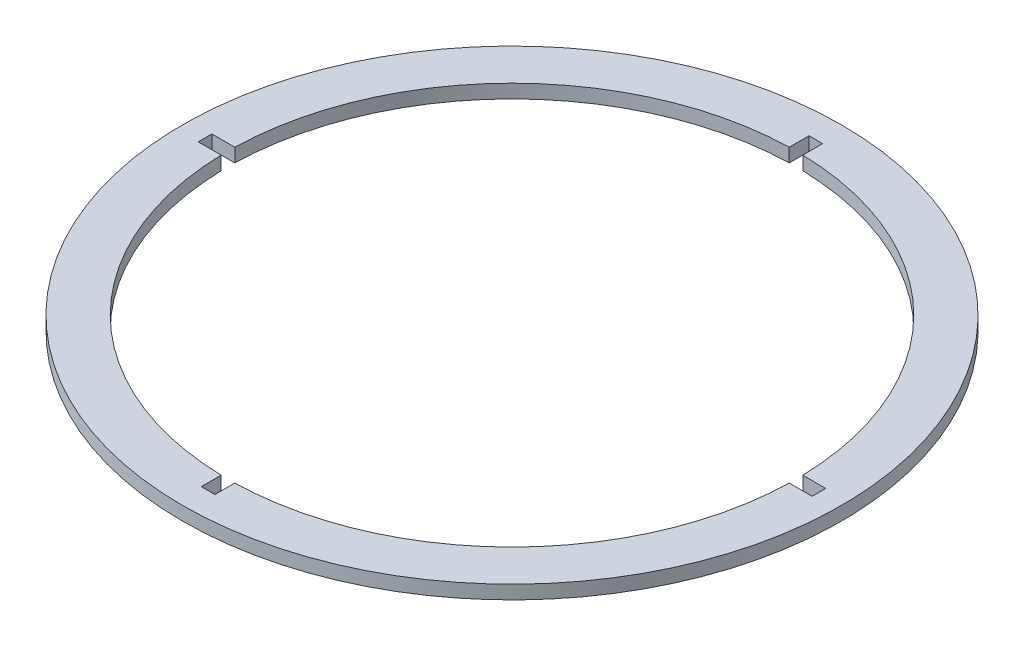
ISO-10303-21;
HEADER;
FILE_DESCRIPTION(('STEP AP214'),'2;1');
FILE_NAME('part.step','',(''),(''),'','','');
FILE_SCHEMA(('AUTOMOTIVE_DESIGN { 1 0 10303 214 1 1 1 1 }'));
ENDSEC;
DATA;
#1=APPLICATION_CONTEXT('core data for automotive mechanical design processes');
#2=APPLICATION_PROTOCOL_DEFINITION('international standard','automotive_design',2000,#1);
#3=PRODUCT_CONTEXT('',#1,'mechanical');
#4=PRODUCT('Part','Part','',(#3));
#5=PRODUCT_RELATED_PRODUCT_CATEGORY('part','',(#4));
#6=PRODUCT_DEFINITION_FORMATION('','',#4);
#7=PRODUCT_DEFINITION_CONTEXT('part definition',#1,'design');
#8=PRODUCT_DEFINITION('design','',#6,#7);
#9=PRODUCT_DEFINITION_SHAPE('','',#8);
#10=(LENGTH_UNIT() NAMED_UNIT(*) SI_UNIT(.MILLI.,.METRE.));
#11=(NAMED_UNIT(*) PLANE_ANGLE_UNIT() SI_UNIT($,.RADIAN.));
#12=(NAMED_UNIT(*) SI_UNIT($,.STERADIAN.) SOLID_ANGLE_UNIT());
#13=UNCERTAINTY_MEASURE_WITH_UNIT(LENGTH_MEASURE(1.E-05),#10,'distance_accuracy_value','');
#14=(GEOMETRIC_REPRESENTATION_CONTEXT(3) GLOBAL_UNCERTAINTY_ASSIGNED_CONTEXT((#13)) GLOBAL_UNIT_ASSIGNED_CONTEXT((#10,
#11,#12)) REPRESENTATION_CONTEXT('',''));
#15=CARTESIAN_POINT('',(0.,0.,0.));
#16=DIRECTION('',(0.,0.,1.));
#17=DIRECTION('',(1.,0.,0.));
#18=AXIS2_PLACEMENT_3D('',#15,#16,#17);
#19=CARTESIAN_POINT('',(0.,12.,0.));
#20=DIRECTION('',(0.,-1.,0.));
#21=DIRECTION('',(0.,0.,-1.));
#22=AXIS2_PLACEMENT_3D('',#19,#20,#21);
#23=CYLINDRICAL_SURFACE('',#22,250.);
#24=CARTESIAN_POINT('',(0.,0.,0.));
#25=DIRECTION('',(0.,1.,0.));
#26=DIRECTION('',(0.,0.,1.));
#27=AXIS2_PLACEMENT_3D('',#24,#25,#26);
#28=CIRCLE('',#27,250.);
#29=CARTESIAN_POINT('',(249.927989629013,0.,-6.));
#30=VERTEX_POINT('',#29);
#31=CARTESIAN_POINT('',(6.00000000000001,0.,-249.927989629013));
#32=VERTEX_POINT('',#31);
#33=EDGE_CURVE('E181',#30,#32,#28,.T.);
#34=ORIENTED_EDGE('',*,*,#33,.F.);
#35=DIRECTION('',(0.,-1.,0.));
#36=VECTOR('',#35,1.);
#37=CARTESIAN_POINT('',(249.927989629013,12.,-6.));
#38=LINE('',#37,#36);
#39=CARTESIAN_POINT('',(249.927989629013,12.,-6.));
#40=VERTEX_POINT('',#39);
#41=EDGE_CURVE('E11',#40,#30,#38,.T.);
#42=ORIENTED_EDGE('',*,*,#41,.F.);
#43=CARTESIAN_POINT('',(0.,12.,0.));
#44=DIRECTION('',(0.,1.,0.));
#45=DIRECTION('',(0.,0.,1.));
#46=AXIS2_PLACEMENT_3D('',#43,#44,#45);
#47=CIRCLE('',#46,250.);
#48=CARTESIAN_POINT('',(6.00000000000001,12.,-249.927989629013));
#49=VERTEX_POINT('',#48);
#50=EDGE_CURVE('E227',#40,#49,#47,.T.);
#51=ORIENTED_EDGE('',*,*,#50,.T.);
#52=DIRECTION('',(0.,-1.,0.));
#53=VECTOR('',#52,1.);
#54=CARTESIAN_POINT('',(6.00000000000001,12.,-249.927989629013));
#55=LINE('',#54,#53);
#56=EDGE_CURVE('E51',#49,#32,#55,.T.);
#57=ORIENTED_EDGE('',*,*,#56,.T.);
#58=EDGE_LOOP('',(#34,#42,#51,#57));
#59=FACE_BOUND('',#58,.T.);
#60=ADVANCED_FACE('F35',(#59),#23,.F.);
#61=CARTESIAN_POINT('',(0.,12.,-6.00000000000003));
#62=DIRECTION('',(0.,0.,-1.));
#63=DIRECTION('',(-1.,0.,0.));
#64=AXIS2_PLACEMENT_3D('',#61,#62,#63);
#65=PLANE('',#64);
#66=DIRECTION('',(1.,0.,0.));
#67=VECTOR('',#66,1.);
#68=CARTESIAN_POINT('',(0.,0.,-6.00000000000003));
#69=LINE('',#68,#67);
#70=CARTESIAN_POINT('',(270.134023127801,0.,-5.99999999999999));
#71=VERTEX_POINT('',#70);
#72=EDGE_CURVE('E183',#30,#71,#69,.T.);
#73=ORIENTED_EDGE('',*,*,#72,.T.);
#74=DIRECTION('',(0.,-1.,0.));
#75=VECTOR('',#74,1.);
#76=CARTESIAN_POINT('',(270.134023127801,12.,-5.99999999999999));
#77=LINE('',#76,#75);
#78=CARTESIAN_POINT('',(270.134023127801,12.,-5.99999999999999));
#79=VERTEX_POINT('',#78);
#80=EDGE_CURVE('E43',#79,#71,#77,.T.);
#81=ORIENTED_EDGE('',*,*,#80,.F.);
#82=DIRECTION('',(1.,0.,0.));
#83=VECTOR('',#82,1.);
#84=CARTESIAN_POINT('',(0.,12.,-6.00000000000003));
#85=LINE('',#84,#83);
#86=EDGE_CURVE('E277',#40,#79,#85,.T.);
#87=ORIENTED_EDGE('',*,*,#86,.F.);
#88=ORIENTED_EDGE('',*,*,#41,.T.);
#89=EDGE_LOOP('',(#73,#81,#87,#88));
#90=FACE_BOUND('',#89,.T.);
#91=ADVANCED_FACE('F314',(#90),#65,.F.);
#92=CARTESIAN_POINT('',(270.134023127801,12.,0.));
#93=DIRECTION('',(1.,0.,0.));
#94=DIRECTION('',(0.,0.,-1.));
#95=AXIS2_PLACEMENT_3D('',#92,#93,#94);
#96=PLANE('',#95);
#97=DIRECTION('',(0.,0.,1.));
#98=VECTOR('',#97,1.);
#99=CARTESIAN_POINT('',(270.134023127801,0.,0.));
#100=LINE('',#99,#98);
#101=CARTESIAN_POINT('',(270.134023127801,0.,6.00000000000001));
#102=VERTEX_POINT('',#101);
#103=EDGE_CURVE('E185',#71,#102,#100,.T.);
#104=ORIENTED_EDGE('',*,*,#103,.T.);
#105=DIRECTION('',(0.,-1.,0.));
#106=VECTOR('',#105,1.);
#107=CARTESIAN_POINT('',(270.134023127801,12.,6.00000000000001));
#108=LINE('',#107,#106);
#109=CARTESIAN_POINT('',(270.134023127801,12.,6.00000000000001));
#110=VERTEX_POINT('',#109);
#111=EDGE_CURVE('E249',#110,#102,#108,.T.);
#112=ORIENTED_EDGE('',*,*,#111,.F.);
#113=DIRECTION('',(0.,0.,1.));
#114=VECTOR('',#113,1.);
#115=CARTESIAN_POINT('',(270.134023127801,12.,0.));
#116=LINE('',#115,#114);
#117=EDGE_CURVE('E257',#79,#110,#116,.T.);
#118=ORIENTED_EDGE('',*,*,#117,.F.);
#119=ORIENTED_EDGE('',*,*,#80,.T.);
#120=EDGE_LOOP('',(#104,#112,#118,#119));
#121=FACE_BOUND('',#120,.T.);
#122=ADVANCED_FACE('F255',(#121),#96,.F.);
#123=CARTESIAN_POINT('',(0.,12.,5.99999999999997));
#124=DIRECTION('',(0.,0.,-1.));
#125=DIRECTION('',(-1.,0.,0.));
#126=AXIS2_PLACEMENT_3D('',#123,#124,#125);
#127=PLANE('',#126);
#128=DIRECTION('',(1.,0.,0.));
#129=VECTOR('',#128,1.);
#130=CARTESIAN_POINT('',(0.,0.,5.99999999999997));
#131=LINE('',#130,#129);
#132=CARTESIAN_POINT('',(249.927989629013,0.,6.));
#133=VERTEX_POINT('',#132);
#134=EDGE_CURVE('E188',#133,#102,#131,.T.);
#135=ORIENTED_EDGE('',*,*,#134,.F.);
#136=DIRECTION('',(0.,-1.,0.));
#137=VECTOR('',#136,1.);
#138=CARTESIAN_POINT('',(249.927989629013,12.,6.));
#139=LINE('',#138,#137);
#140=CARTESIAN_POINT('',(249.927989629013,12.,6.));
#141=VERTEX_POINT('',#140);
#142=EDGE_CURVE('E247',#141,#133,#139,.T.);
#143=ORIENTED_EDGE('',*,*,#142,.F.);
#144=DIRECTION('',(1.,0.,0.));
#145=VECTOR('',#144,1.);
#146=CARTESIAN_POINT('',(0.,12.,5.99999999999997));
#147=LINE('',#146,#145);
#148=EDGE_CURVE('E270',#141,#110,#147,.T.);
#149=ORIENTED_EDGE('',*,*,#148,.T.);
#150=ORIENTED_EDGE('',*,*,#111,.T.);
#151=EDGE_LOOP('',(#135,#143,#149,#150));
#152=FACE_BOUND('',#151,.T.);
#153=ADVANCED_FACE('F267',(#152),#127,.T.);
#154=CARTESIAN_POINT('',(0.,12.,0.));
#155=DIRECTION('',(0.,-1.,0.));
#156=DIRECTION('',(0.,0.,-1.));
#157=AXIS2_PLACEMENT_3D('',#154,#155,#156);
#158=CYLINDRICAL_SURFACE('',#157,250.);
#159=CARTESIAN_POINT('',(0.,0.,0.));
#160=DIRECTION('',(0.,1.,0.));
#161=DIRECTION('',(0.,0.,1.));
#162=AXIS2_PLACEMENT_3D('',#159,#160,#161);
#163=CIRCLE('',#162,250.);
#164=CARTESIAN_POINT('',(6.00000000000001,0.,249.927989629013));
#165=VERTEX_POINT('',#164);
#166=EDGE_CURVE('E191',#165,#133,#163,.T.);
#167=ORIENTED_EDGE('',*,*,#166,.F.);
#168=DIRECTION('',(0.,-1.,0.));
#169=VECTOR('',#168,1.);
#170=CARTESIAN_POINT('',(6.00000000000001,12.,249.927989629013));
#171=LINE('',#170,#169);
#172=CARTESIAN_POINT('',(6.00000000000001,12.,249.927989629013));
#173=VERTEX_POINT('',#172);
#174=EDGE_CURVE('E245',#173,#165,#171,.T.);
#175=ORIENTED_EDGE('',*,*,#174,.F.);
#176=CARTESIAN_POINT('',(0.,12.,0.));
#177=DIRECTION('',(0.,1.,0.));
#178=DIRECTION('',(0.,0.,1.));
#179=AXIS2_PLACEMENT_3D('',#176,#177,#178);
#180=CIRCLE('',#179,250.);
#181=EDGE_CURVE('E273',#173,#141,#180,.T.);
#182=ORIENTED_EDGE('',*,*,#181,.T.);
#183=ORIENTED_EDGE('',*,*,#142,.T.);
#184=EDGE_LOOP('',(#167,#175,#182,#183));
#185=FACE_BOUND('',#184,.T.);
#186=ADVANCED_FACE('F325',(#185),#158,.F.);
#187=CARTESIAN_POINT('',(6.00000000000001,12.,0.));
#188=DIRECTION('',(1.,0.,0.));
#189=DIRECTION('',(0.,0.,-1.));
#190=AXIS2_PLACEMENT_3D('',#187,#188,#189);
#191=PLANE('',#190);
#192=DIRECTION('',(0.,0.,1.));
#193=VECTOR('',#192,1.);
#194=CARTESIAN_POINT('',(6.00000000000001,0.,0.));
#195=LINE('',#194,#193);
#196=CARTESIAN_POINT('',(6.00000000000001,0.,267.411669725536));
#197=VERTEX_POINT('',#196);
#198=EDGE_CURVE('E194',#165,#197,#195,.T.);
#199=ORIENTED_EDGE('',*,*,#198,.T.);
#200=DIRECTION('',(0.,-1.,0.));
#201=VECTOR('',#200,1.);
#202=CARTESIAN_POINT('',(6.00000000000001,12.,267.411669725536));
#203=LINE('',#202,#201);
#204=CARTESIAN_POINT('',(6.00000000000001,12.,267.411669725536));
#205=VERTEX_POINT('',#204);
#206=EDGE_CURVE('E243',#205,#197,#203,.T.);
#207=ORIENTED_EDGE('',*,*,#206,.F.);
#208=DIRECTION('',(0.,0.,1.));
#209=VECTOR('',#208,1.);
#210=CARTESIAN_POINT('',(6.00000000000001,12.,0.));
#211=LINE('',#210,#209);
#212=EDGE_CURVE('E275',#173,#205,#211,.T.);
#213=ORIENTED_EDGE('',*,*,#212,.F.);
#214=ORIENTED_EDGE('',*,*,#174,.T.);
#215=EDGE_LOOP('',(#199,#207,#213,#214));
#216=FACE_BOUND('',#215,.T.);
#217=ADVANCED_FACE('F328',(#216),#191,.F.);
#218=CARTESIAN_POINT('',(0.,12.,267.411669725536));
#219=DIRECTION('',(0.,0.,-1.));
#220=DIRECTION('',(-1.,0.,0.));
#221=AXIS2_PLACEMENT_3D('',#218,#219,#220);
#222=PLANE('',#221);
#223=DIRECTION('',(1.,0.,0.));
#224=VECTOR('',#223,1.);
#225=CARTESIAN_POINT('',(0.,0.,267.411669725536));
#226=LINE('',#225,#224);
#227=CARTESIAN_POINT('',(-5.99999999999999,0.,267.411669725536));
#228=VERTEX_POINT('',#227);
#229=EDGE_CURVE('E197',#228,#197,#226,.T.);
#230=ORIENTED_EDGE('',*,*,#229,.F.);
#231=DIRECTION('',(0.,-1.,0.));
#232=VECTOR('',#231,1.);
#233=CARTESIAN_POINT('',(-5.99999999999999,12.,267.411669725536));
#234=LINE('',#233,#232);
#235=CARTESIAN_POINT('',(-5.99999999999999,12.,267.411669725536));
#236=VERTEX_POINT('',#235);
#237=EDGE_CURVE('E241',#236,#228,#234,.T.);
#238=ORIENTED_EDGE('',*,*,#237,.F.);
#239=DIRECTION('',(1.,0.,0.));
#240=VECTOR('',#239,1.);
#241=CARTESIAN_POINT('',(0.,12.,267.411669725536));
#242=LINE('',#241,#240);
#243=EDGE_CURVE('E282',#236,#205,#242,.T.);
#244=ORIENTED_EDGE('',*,*,#243,.T.);
#245=ORIENTED_EDGE('',*,*,#206,.T.);
#246=EDGE_LOOP('',(#230,#238,#244,#245));
#247=FACE_BOUND('',#246,.T.);
#248=ADVANCED_FACE('F332',(#247),#222,.T.);
#249=CARTESIAN_POINT('',(-5.99999999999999,12.,0.));
#250=DIRECTION('',(1.,0.,0.));
#251=DIRECTION('',(0.,0.,-1.));
#252=AXIS2_PLACEMENT_3D('',#249,#250,#251);
#253=PLANE('',#252);
#254=DIRECTION('',(0.,0.,1.));
#255=VECTOR('',#254,1.);
#256=CARTESIAN_POINT('',(-5.99999999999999,0.,0.));
#257=LINE('',#256,#255);
#258=CARTESIAN_POINT('',(-5.99999999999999,0.,249.927989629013));
#259=VERTEX_POINT('',#258);
#260=EDGE_CURVE('E200',#259,#228,#257,.T.);
#261=ORIENTED_EDGE('',*,*,#260,.F.);
#262=DIRECTION('',(0.,-1.,0.));
#263=VECTOR('',#262,1.);
#264=CARTESIAN_POINT('',(-5.99999999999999,12.,249.927989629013));
#265=LINE('',#264,#263);
#266=CARTESIAN_POINT('',(-5.99999999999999,12.,249.927989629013));
#267=VERTEX_POINT('',#266);
#268=EDGE_CURVE('E239',#267,#259,#265,.T.);
#269=ORIENTED_EDGE('',*,*,#268,.F.);
#270=DIRECTION('',(0.,0.,1.));
#271=VECTOR('',#270,1.);
#272=CARTESIAN_POINT('',(-5.99999999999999,12.,0.));
#273=LINE('',#272,#271);
#274=EDGE_CURVE('E285',#267,#236,#273,.T.);
#275=ORIENTED_EDGE('',*,*,#274,.T.);
#276=ORIENTED_EDGE('',*,*,#237,.T.);
#277=EDGE_LOOP('',(#261,#269,#275,#276));
#278=FACE_BOUND('',#277,.T.);
#279=ADVANCED_FACE('F336',(#278),#253,.T.);
#280=CARTESIAN_POINT('',(0.,12.,0.));
#281=DIRECTION('',(0.,-1.,0.));
#282=DIRECTION('',(0.,0.,-1.));
#283=AXIS2_PLACEMENT_3D('',#280,#281,#282);
#284=CYLINDRICAL_SURFACE('',#283,250.);
#285=CARTESIAN_POINT('',(0.,0.,0.));
#286=DIRECTION('',(0.,1.,0.));
#287=DIRECTION('',(0.,0.,1.));
#288=AXIS2_PLACEMENT_3D('',#285,#286,#287);
#289=CIRCLE('',#288,250.);
#290=CARTESIAN_POINT('',(-249.927989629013,0.,6.));
#291=VERTEX_POINT('',#290);
#292=EDGE_CURVE('E203',#291,#259,#289,.T.);
#293=ORIENTED_EDGE('',*,*,#292,.F.);
#294=DIRECTION('',(0.,-1.,0.));
#295=VECTOR('',#294,1.);
#296=CARTESIAN_POINT('',(-249.927989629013,12.,6.));
#297=LINE('',#296,#295);
#298=CARTESIAN_POINT('',(-249.927989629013,12.,6.));
#299=VERTEX_POINT('',#298);
#300=EDGE_CURVE('E237',#299,#291,#297,.T.);
#301=ORIENTED_EDGE('',*,*,#300,.F.);
#302=CARTESIAN_POINT('',(0.,12.,0.));
#303=DIRECTION('',(0.,1.,0.));
#304=DIRECTION('',(0.,0.,1.));
#305=AXIS2_PLACEMENT_3D('',#302,#303,#304);
#306=CIRCLE('',#305,250.);
#307=EDGE_CURVE('E288',#299,#267,#306,.T.);
#308=ORIENTED_EDGE('',*,*,#307,.T.);
#309=ORIENTED_EDGE('',*,*,#268,.T.);
#310=EDGE_LOOP('',(#293,#301,#308,#309));
#311=FACE_BOUND('',#310,.T.);
#312=ADVANCED_FACE('F340',(#311),#284,.F.);
#313=CARTESIAN_POINT('',(0.,12.,5.99999999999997));
#314=DIRECTION('',(0.,0.,1.));
#315=DIRECTION('',(1.,0.,0.));
#316=AXIS2_PLACEMENT_3D('',#313,#314,#315);
#317=PLANE('',#316);
#318=DIRECTION('',(-1.,0.,0.));
#319=VECTOR('',#318,1.);
#320=CARTESIAN_POINT('',(0.,0.,5.99999999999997));
#321=LINE('',#320,#319);
#322=CARTESIAN_POINT('',(-270.134023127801,0.,6.00000000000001));
#323=VERTEX_POINT('',#322);
#324=EDGE_CURVE('E206',#291,#323,#321,.T.);
#325=ORIENTED_EDGE('',*,*,#324,.T.);
#326=DIRECTION('',(0.,-1.,0.));
#327=VECTOR('',#326,1.);
#328=CARTESIAN_POINT('',(-270.134023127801,12.,6.00000000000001));
#329=LINE('',#328,#327);
#330=CARTESIAN_POINT('',(-270.134023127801,12.,6.00000000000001));
#331=VERTEX_POINT('',#330);
#332=EDGE_CURVE('E235',#331,#323,#329,.T.);
#333=ORIENTED_EDGE('',*,*,#332,.F.);
#334=DIRECTION('',(-1.,0.,0.));
#335=VECTOR('',#334,1.);
#336=CARTESIAN_POINT('',(0.,12.,5.99999999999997));
#337=LINE('',#336,#335);
#338=EDGE_CURVE('E291',#299,#331,#337,.T.);
#339=ORIENTED_EDGE('',*,*,#338,.F.);
#340=ORIENTED_EDGE('',*,*,#300,.T.);
#341=EDGE_LOOP('',(#325,#333,#339,#340));
#342=FACE_BOUND('',#341,.T.);
#343=ADVANCED_FACE('F344',(#342),#317,.F.);
#344=CARTESIAN_POINT('',(-270.134023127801,12.,0.));
#345=DIRECTION('',(1.,0.,0.));
#346=DIRECTION('',(0.,0.,-1.));
#347=AXIS2_PLACEMENT_3D('',#344,#345,#346);
#348=PLANE('',#347);
#349=DIRECTION('',(0.,0.,1.));
#350=VECTOR('',#349,1.);
#351=CARTESIAN_POINT('',(-270.134023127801,0.,0.));
#352=LINE('',#351,#350);
#353=CARTESIAN_POINT('',(-270.134023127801,0.,-5.99999999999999));
#354=VERTEX_POINT('',#353);
#355=EDGE_CURVE('E209',#354,#323,#352,.T.);
#356=ORIENTED_EDGE('',*,*,#355,.F.);
#357=DIRECTION('',(0.,-1.,0.));
#358=VECTOR('',#357,1.);
#359=CARTESIAN_POINT('',(-270.134023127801,12.,-5.99999999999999));
#360=LINE('',#359,#358);
#361=CARTESIAN_POINT('',(-270.134023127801,12.,-5.99999999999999));
#362=VERTEX_POINT('',#361);
#363=EDGE_CURVE('E233',#362,#354,#360,.T.);
#364=ORIENTED_EDGE('',*,*,#363,.F.);
#365=DIRECTION('',(0.,0.,1.));
#366=VECTOR('',#365,1.);
#367=CARTESIAN_POINT('',(-270.134023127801,12.,0.));
#368=LINE('',#367,#366);
#369=EDGE_CURVE('E293',#362,#331,#368,.T.);
#370=ORIENTED_EDGE('',*,*,#369,.T.);
#371=ORIENTED_EDGE('',*,*,#332,.T.);
#372=EDGE_LOOP('',(#356,#364,#370,#371));
#373=FACE_BOUND('',#372,.T.);
#374=ADVANCED_FACE('F348',(#373),#348,.T.);
#375=CARTESIAN_POINT('',(0.,12.,-6.00000000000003));
#376=DIRECTION('',(0.,0.,1.));
#377=DIRECTION('',(1.,0.,0.));
#378=AXIS2_PLACEMENT_3D('',#375,#376,#377);
#379=PLANE('',#378);
#380=DIRECTION('',(-1.,0.,0.));
#381=VECTOR('',#380,1.);
#382=CARTESIAN_POINT('',(0.,0.,-6.00000000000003));
#383=LINE('',#382,#381);
#384=CARTESIAN_POINT('',(-249.927989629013,0.,-6.));
#385=VERTEX_POINT('',#384);
#386=EDGE_CURVE('E212',#385,#354,#383,.T.);
#387=ORIENTED_EDGE('',*,*,#386,.F.);
#388=DIRECTION('',(0.,-1.,0.));
#389=VECTOR('',#388,1.);
#390=CARTESIAN_POINT('',(-249.927989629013,12.,-6.));
#391=LINE('',#390,#389);
#392=CARTESIAN_POINT('',(-249.927989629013,12.,-6.));
#393=VERTEX_POINT('',#392);
#394=EDGE_CURVE('E231',#393,#385,#391,.T.);
#395=ORIENTED_EDGE('',*,*,#394,.F.);
#396=DIRECTION('',(-1.,0.,0.));
#397=VECTOR('',#396,1.);
#398=CARTESIAN_POINT('',(0.,12.,-6.00000000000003));
#399=LINE('',#398,#397);
#400=EDGE_CURVE('E296',#393,#362,#399,.T.);
#401=ORIENTED_EDGE('',*,*,#400,.T.);
#402=ORIENTED_EDGE('',*,*,#363,.T.);
#403=EDGE_LOOP('',(#387,#395,#401,#402));
#404=FACE_BOUND('',#403,.T.);
#405=ADVANCED_FACE('F352',(#404),#379,.T.);
#406=CARTESIAN_POINT('',(0.,12.,0.));
#407=DIRECTION('',(0.,-1.,0.));
#408=DIRECTION('',(0.,0.,-1.));
#409=AXIS2_PLACEMENT_3D('',#406,#407,#408);
#410=CYLINDRICAL_SURFACE('',#409,250.);
#411=CARTESIAN_POINT('',(0.,0.,0.));
#412=DIRECTION('',(0.,1.,0.));
#413=DIRECTION('',(0.,0.,1.));
#414=AXIS2_PLACEMENT_3D('',#411,#412,#413);
#415=CIRCLE('',#414,250.);
#416=CARTESIAN_POINT('',(-5.99999999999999,0.,-249.927989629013));
#417=VERTEX_POINT('',#416);
#418=EDGE_CURVE('E215',#417,#385,#415,.T.);
#419=ORIENTED_EDGE('',*,*,#418,.F.);
#420=DIRECTION('',(0.,-1.,0.));
#421=VECTOR('',#420,1.);
#422=CARTESIAN_POINT('',(-5.99999999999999,12.,-249.927989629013));
#423=LINE('',#422,#421);
#424=CARTESIAN_POINT('',(-5.99999999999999,12.,-249.927989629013));
#425=VERTEX_POINT('',#424);
#426=EDGE_CURVE('E170',#425,#417,#423,.T.);
#427=ORIENTED_EDGE('',*,*,#426,.F.);
#428=CARTESIAN_POINT('',(0.,12.,0.));
#429=DIRECTION('',(0.,1.,0.));
#430=DIRECTION('',(0.,0.,1.));
#431=AXIS2_PLACEMENT_3D('',#428,#429,#430);
#432=CIRCLE('',#431,250.);
#433=EDGE_CURVE('E160',#425,#393,#432,.T.);
#434=ORIENTED_EDGE('',*,*,#433,.T.);
#435=ORIENTED_EDGE('',*,*,#394,.T.);
#436=EDGE_LOOP('',(#419,#427,#434,#435));
#437=FACE_BOUND('',#436,.T.);
#438=ADVANCED_FACE('F300',(#437),#410,.F.);
#439=CARTESIAN_POINT('',(-5.99999999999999,12.,0.));
#440=DIRECTION('',(-1.,0.,0.));
#441=DIRECTION('',(0.,0.,1.));
#442=AXIS2_PLACEMENT_3D('',#439,#440,#441);
#443=PLANE('',#442);
#444=DIRECTION('',(0.,0.,-1.));
#445=VECTOR('',#444,1.);
#446=CARTESIAN_POINT('',(-5.99999999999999,0.,0.));
#447=LINE('',#446,#445);
#448=CARTESIAN_POINT('',(-5.99999999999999,0.,-267.411669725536));
#449=VERTEX_POINT('',#448);
#450=EDGE_CURVE('E167',#417,#449,#447,.T.);
#451=ORIENTED_EDGE('',*,*,#450,.T.);
#452=DIRECTION('',(0.,-1.,0.));
#453=VECTOR('',#452,1.);
#454=CARTESIAN_POINT('',(-5.99999999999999,12.,-267.411669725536));
#455=LINE('',#454,#453);
#456=CARTESIAN_POINT('',(-5.99999999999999,12.,-267.411669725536));
#457=VERTEX_POINT('',#456);
#458=EDGE_CURVE('E164',#457,#449,#455,.T.);
#459=ORIENTED_EDGE('',*,*,#458,.F.);
#460=DIRECTION('',(0.,0.,-1.));
#461=VECTOR('',#460,1.);
#462=CARTESIAN_POINT('',(-5.99999999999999,12.,0.));
#463=LINE('',#462,#461);
#464=EDGE_CURVE('E150',#425,#457,#463,.T.);
#465=ORIENTED_EDGE('',*,*,#464,.F.);
#466=ORIENTED_EDGE('',*,*,#426,.T.);
#467=EDGE_LOOP('',(#451,#459,#465,#466));
#468=FACE_BOUND('',#467,.T.);
#469=ADVANCED_FACE('F165',(#468),#443,.F.);
#470=CARTESIAN_POINT('',(0.,12.,-267.411669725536));
#471=DIRECTION('',(0.,0.,-1.));
#472=DIRECTION('',(-1.,0.,0.));
#473=AXIS2_PLACEMENT_3D('',#470,#471,#472);
#474=PLANE('',#473);
#475=DIRECTION('',(1.,0.,0.));
#476=VECTOR('',#475,1.);
#477=CARTESIAN_POINT('',(0.,0.,-267.411669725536));
#478=LINE('',#477,#476);
#479=CARTESIAN_POINT('',(6.00000000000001,0.,-267.411669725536));
#480=VERTEX_POINT('',#479);
#481=EDGE_CURVE('E219',#449,#480,#478,.T.);
#482=ORIENTED_EDGE('',*,*,#481,.T.);
#483=DIRECTION('',(0.,-1.,0.));
#484=VECTOR('',#483,1.);
#485=CARTESIAN_POINT('',(6.00000000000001,12.,-267.411669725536));
#486=LINE('',#485,#484);
#487=CARTESIAN_POINT('',(6.00000000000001,12.,-267.411669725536));
#488=VERTEX_POINT('',#487);
#489=EDGE_CURVE('E101',#488,#480,#486,.T.);
#490=ORIENTED_EDGE('',*,*,#489,.F.);
#491=DIRECTION('',(1.,0.,0.));
#492=VECTOR('',#491,1.);
#493=CARTESIAN_POINT('',(0.,12.,-267.411669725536));
#494=LINE('',#493,#492);
#495=EDGE_CURVE('E157',#457,#488,#494,.T.);
#496=ORIENTED_EDGE('',*,*,#495,.F.);
#497=ORIENTED_EDGE('',*,*,#458,.T.);
#498=EDGE_LOOP('',(#482,#490,#496,#497));
#499=FACE_BOUND('',#498,.T.);
#500=ADVANCED_FACE('F172',(#499),#474,.F.);
#501=CARTESIAN_POINT('',(6.00000000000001,12.,0.));
#502=DIRECTION('',(-1.,0.,0.));
#503=DIRECTION('',(0.,0.,1.));
#504=AXIS2_PLACEMENT_3D('',#501,#502,#503);
#505=PLANE('',#504);
#506=DIRECTION('',(0.,0.,-1.));
#507=VECTOR('',#506,1.);
#508=CARTESIAN_POINT('',(6.00000000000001,0.,0.));
#509=LINE('',#508,#507);
#510=EDGE_CURVE('E221',#32,#480,#509,.T.);
#511=ORIENTED_EDGE('',*,*,#510,.F.);
#512=ORIENTED_EDGE('',*,*,#56,.F.);
#513=DIRECTION('',(0.,0.,-1.));
#514=VECTOR('',#513,1.);
#515=CARTESIAN_POINT('',(6.00000000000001,12.,0.));
#516=LINE('',#515,#514);
#517=EDGE_CURVE('E173',#49,#488,#516,.T.);
#518=ORIENTED_EDGE('',*,*,#517,.T.);
#519=ORIENTED_EDGE('',*,*,#489,.T.);
#520=EDGE_LOOP('',(#511,#512,#518,#519));
#521=FACE_BOUND('',#520,.T.);
#522=ADVANCED_FACE('F302',(#521),#505,.T.);
#523=CARTESIAN_POINT('',(0.,12.,0.));
#524=DIRECTION('',(0.,-1.,0.));
#525=DIRECTION('',(0.,0.,-1.));
#526=AXIS2_PLACEMENT_3D('',#523,#524,#525);
#527=CYLINDRICAL_SURFACE('',#526,290.);
#528=CARTESIAN_POINT('',(0.,12.,0.));
#529=DIRECTION('',(0.,1.,0.));
#530=DIRECTION('',(0.,0.,1.));
#531=AXIS2_PLACEMENT_3D('',#528,#529,#530);
#532=CIRCLE('',#531,290.);
#533=CARTESIAN_POINT('',(0.,12.,290.));
#534=VERTEX_POINT('',#533);
#535=EDGE_CURVE('E175',#534,#534,#532,.T.);
#536=ORIENTED_EDGE('',*,*,#535,.F.);
#537=EDGE_LOOP('',(#536));
#538=FACE_BOUND('',#537,.T.);
#539=CARTESIAN_POINT('',(0.,0.,0.));
#540=DIRECTION('',(0.,1.,0.));
#541=DIRECTION('',(0.,0.,1.));
#542=AXIS2_PLACEMENT_3D('',#539,#540,#541);
#543=CIRCLE('',#542,290.);
#544=CARTESIAN_POINT('',(0.,0.,290.));
#545=VERTEX_POINT('',#544);
#546=EDGE_CURVE('E224',#545,#545,#543,.T.);
#547=ORIENTED_EDGE('',*,*,#546,.T.);
#548=EDGE_LOOP('',(#547));
#549=FACE_BOUND('',#548,.T.);
#550=ADVANCED_FACE('F304',(#538,#549),#527,.T.);
#551=CARTESIAN_POINT('',(0.,12.,0.));
#552=DIRECTION('',(0.,1.,0.));
#553=DIRECTION('',(0.,0.,1.));
#554=AXIS2_PLACEMENT_3D('',#551,#552,#553);
#555=PLANE('',#554);
#556=ORIENTED_EDGE('',*,*,#50,.F.);
#557=ORIENTED_EDGE('',*,*,#86,.T.);
#558=ORIENTED_EDGE('',*,*,#117,.T.);
#559=ORIENTED_EDGE('',*,*,#148,.F.);
#560=ORIENTED_EDGE('',*,*,#181,.F.);
#561=ORIENTED_EDGE('',*,*,#212,.T.);
#562=ORIENTED_EDGE('',*,*,#243,.F.);
#563=ORIENTED_EDGE('',*,*,#274,.F.);
#564=ORIENTED_EDGE('',*,*,#307,.F.);
#565=ORIENTED_EDGE('',*,*,#338,.T.);
#566=ORIENTED_EDGE('',*,*,#369,.F.);
#567=ORIENTED_EDGE('',*,*,#400,.F.);
#568=ORIENTED_EDGE('',*,*,#433,.F.);
#569=ORIENTED_EDGE('',*,*,#464,.T.);
#570=ORIENTED_EDGE('',*,*,#495,.T.);
#571=ORIENTED_EDGE('',*,*,#517,.F.);
#572=EDGE_LOOP('',(#556,#557,#558,#559,#560,#561,#562,#563,#564,#565,#566,#567,#568,#569,#570,#571));
#573=FACE_BOUND('',#572,.T.);
#574=ORIENTED_EDGE('',*,*,#535,.T.);
#575=EDGE_LOOP('',(#574));
#576=FACE_BOUND('',#575,.T.);
#577=ADVANCED_FACE('F153',(#573,#576),#555,.T.);
#578=CARTESIAN_POINT('',(0.,0.,0.));
#579=DIRECTION('',(0.,1.,0.));
#580=DIRECTION('',(0.,0.,1.));
#581=AXIS2_PLACEMENT_3D('',#578,#579,#580);
#582=PLANE('',#581);
#583=ORIENTED_EDGE('',*,*,#33,.T.);
#584=ORIENTED_EDGE('',*,*,#510,.T.);
#585=ORIENTED_EDGE('',*,*,#481,.F.);
#586=ORIENTED_EDGE('',*,*,#450,.F.);
#587=ORIENTED_EDGE('',*,*,#418,.T.);
#588=ORIENTED_EDGE('',*,*,#386,.T.);
#589=ORIENTED_EDGE('',*,*,#355,.T.);
#590=ORIENTED_EDGE('',*,*,#324,.F.);
#591=ORIENTED_EDGE('',*,*,#292,.T.);
#592=ORIENTED_EDGE('',*,*,#260,.T.);
#593=ORIENTED_EDGE('',*,*,#229,.T.);
#594=ORIENTED_EDGE('',*,*,#198,.F.);
#595=ORIENTED_EDGE('',*,*,#166,.T.);
#596=ORIENTED_EDGE('',*,*,#134,.T.);
#597=ORIENTED_EDGE('',*,*,#103,.F.);
#598=ORIENTED_EDGE('',*,*,#72,.F.);
#599=EDGE_LOOP('',(#583,#584,#585,#586,#587,#588,#589,#590,#591,#592,#593,#594,#595,#596,#597,#598));
#600=FACE_BOUND('',#599,.T.);
#601=ORIENTED_EDGE('',*,*,#546,.F.);
#602=EDGE_LOOP('',(#601));
#603=FACE_BOUND('',#602,.T.);
#604=ADVANCED_FACE('F261',(#600,#603),#582,.F.);
#605=CLOSED_SHELL('',(#60,#91,#122,#153,#186,#217,#248,#279,#312,#343,#374,#405,#438,#469,#500,
#522,#550,#577,#604));
#606=MANIFOLD_SOLID_BREP('B2',#605);
#607=ADVANCED_BREP_SHAPE_REPRESENTATION('',(#18,#606),#14);
#608=SHAPE_DEFINITION_REPRESENTATION(#9,#607);
ENDSEC;
END-ISO-10303-21;
